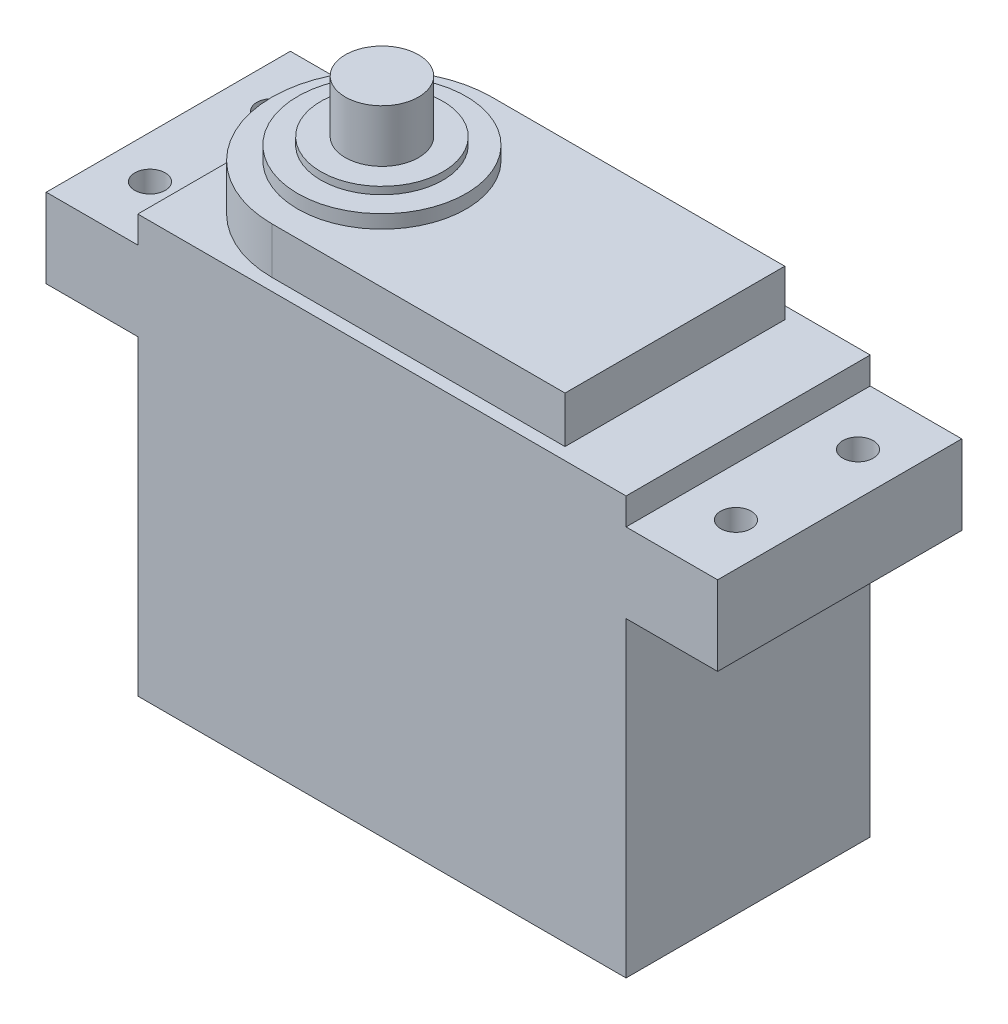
from build123d import *

# Parameters (mm, degrees)
EXTRUSION1_DEPTH        = 10
ESQUISSE2_R             = 1.25
ENL_V_MAT_EXTRU_1_DEPTH = 59.139917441
EXTRUSION2_DEPTH        = 3.8
ESQUISSE4_R             = 6.9
EXTRUSION3_DEPTH        = 1.1
ESQUISSE5_R             = 5
EXTRUSION4_DEPTH        = 0.6
ESQUISSE8_R             = 3
BOSS_EXTRU_1_DEPTH      = 4.3
ESQUISSE9_W             = 6
ESQUISSE9_H             = 3
BOSS_EXTRU_2_DEPTH      = 0.5
ESQUISSE10_R            = 0.65
BOSS_EXTRU_3_DEPTH      = 5


with BuildPart() as part:
    # Esquisse1 → Extrusion1 (new, symmetric)
    with BuildSketch(Plane.XY):
        Polygon((47.5, 32), (40, 32), (40, 34.2), (0, 34.2), (0, 32), (-7.5, 32), (-7.5, 25.5), (0, 25.5), (0, 0), (40, 0), (40, 25.5), (47.5, 25.5), align=None)
    extrude(amount=EXTRUSION1_DEPTH, both=True)

    # Esquisse2 → Enl_v. mat.-Extru.1 (cut, through all)
    with BuildSketch(Plane(origin=(0, 32, 0), x_dir=(1, 0, 0), z_dir=(0, 1, 0))):
        with Locations(Location((-4, 5, 0), (0, 0, 270))):
            Circle(ESQUISSE2_R)
        with Locations(Location((-4, -5, 0), (0, 0, 270))):
            Circle(ESQUISSE2_R)
        with Locations(Location((44, -5, 0), (0, 0, 270))):
            Circle(ESQUISSE2_R)
        with Locations(Location((44, 5, 0), (0, 0, 270))):
            Circle(ESQUISSE2_R)
    extrude(amount=-ENL_V_MAT_EXTRU_1_DEPTH, mode=Mode.SUBTRACT)

    # Esquisse3 → Extrusion2 (add)
    with BuildSketch(Plane(origin=(0, 34.2, 0), x_dir=(1, 0, 0), z_dir=(0, 1, 0))):
        with BuildLine():
            Line((10, 9), (34, 9))
            Line((34, 9), (34, -9))
            Line((34, -9), (10, -9))
            ThreePointArc((10, -9), (1, 0), (10, 9))
        make_face()
    extrude(amount=EXTRUSION2_DEPTH)

    # Esquisse4 → Extrusion3 (add)
    with BuildSketch(Plane(origin=(0, 38, 0), x_dir=(1, 0, 0), z_dir=(0, 1, 0))):
        with Locations(Location((10, 0, 0), (0, 0, 270))):
            Circle(ESQUISSE4_R)
    extrude(amount=EXTRUSION3_DEPTH)

    # Esquisse5 → Extrusion4 (add)
    with BuildSketch(Plane(origin=(0, 39.1, 0), x_dir=(1, 0, 0), z_dir=(0, 1, 0))):
        with Locations(Location((10, 0, 0), (0, 0, 270))):
            Circle(ESQUISSE5_R)
    extrude(amount=EXTRUSION4_DEPTH)

    # Esquisse8 → Boss.-Extru.1 (add)
    with BuildSketch(Plane(origin=(0, 39.7, 0), x_dir=(1, 0, 0), z_dir=(0, 1, 0))):
        with Locations(Location((10, 0, 0), (0, 0, 270))):
            Circle(ESQUISSE8_R)
    extrude(amount=BOSS_EXTRU_1_DEPTH)

    # Esquisse9 → Boss.-Extru.2 (add)
    with BuildSketch(Plane.ZY):
        with Locations((0, 2)):
            Rectangle(ESQUISSE9_W, ESQUISSE9_H)
    extrude(amount=BOSS_EXTRU_2_DEPTH)

    # Esquisse10 → Boss.-Extru.3 (add)
    with BuildSketch(Plane.ZY.offset(0.5)):
        with Locations((-1.31, 2)):
            Circle(ESQUISSE10_R)
        with Locations((0, 2)):
            Circle(ESQUISSE10_R)
        with Locations((1.31, 2)):
            Circle(ESQUISSE10_R)
    extrude(amount=BOSS_EXTRU_3_DEPTH)


solid = part.part
